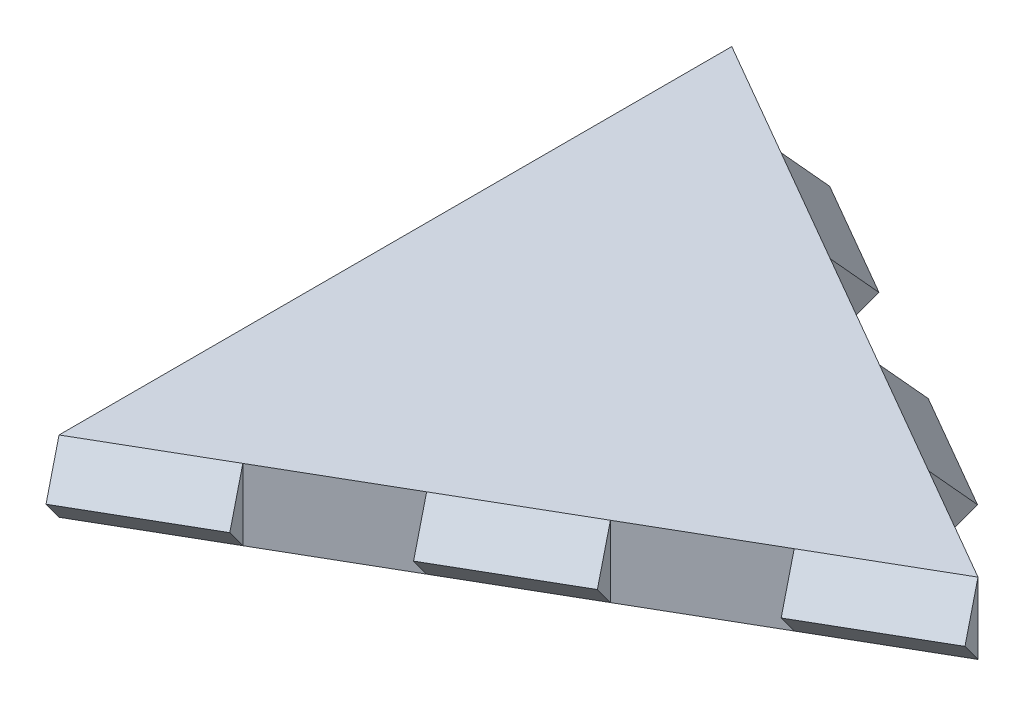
from build123d import *

# Parameters (mm, degrees)
SALIENTE_EXTRUIR1_DEPTH = 4.24
CROQUIS4_W              = 40
CROQUIS4_H              = 4.24
SALIENTE_EXTRUIR2_DEPTH = 4.24
CORTAR_EXTRUIR1_DEPTH   = 4.24
CORTAR_EXTRUIR2_DEPTH   = 54.24
CROQUIS7_W              = 40
CROQUIS7_H              = 4.24
SALIENTE_EXTRUIR3_DEPTH = 4.24
CROQUIS8_W              = 4.24
CROQUIS8_H              = 8
CORTAR_EXTRUIR3_DEPTH   = 4.24
CORTAR_EXTRUIR4_DEPTH   = 34.24
CROQUIS10_W             = 40
CROQUIS10_H             = 4.24
SALIENTE_EXTRUIR4_DEPTH = 4.24
CORTAR_EXTRUIR5_DEPTH   = 4.24
CORTAR_EXTRUIR6_DEPTH   = 44.24


with BuildPart() as part:
    # Croquis1 → Saliente-Extruir1 (new body)
    with BuildSketch(Plane(origin=(0, 0, 0), x_dir=(1, 0, 0), z_dir=(0, 1, 0))):
        Polygon((23.094010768, 0), (-11.547005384, 20), (-11.547005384, -20), align=None)
    extrude(amount=SALIENTE_EXTRUIR1_DEPTH)

    # Croquis4 → Saliente-Extruir2 (add)
    with BuildSketch(Plane(origin=(5.773502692, 0, 10), x_dir=(0.8660254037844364, 0, -0.500000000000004), z_dir=(0.500000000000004, 0, 0.8660254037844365))):
        with Locations((0, 2.12)):
            Rectangle(CROQUIS4_W, CROQUIS4_H)
    extrude(amount=SALIENTE_EXTRUIR2_DEPTH)

    # Croquis5 → Cortar-Extruir1 (cut)
    with BuildSketch(Plane(origin=(0, 4.24, 0), x_dir=(1, 0, 0), z_dir=(0, 1, 0))):
        Polygon((11.357604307, -11.671947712), (9.237604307, -8), (16.165807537, -4), (18.285807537, -7.671947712), align=None)
        Polygon((4.429401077, -15.671947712), (2.309401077, -12), (-4.618802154, -16), (-2.498802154, -19.671947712), align=None)
    extrude(amount=-CORTAR_EXTRUIR1_DEPTH, mode=Mode.SUBTRACT)

    # Croquis6 → Cortar-Extruir2 (cut)
    with BuildSketch(Plane(origin=(-17.320508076, 0, 10), x_dir=(0.5000000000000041, 0, 0.8660254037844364), z_dir=(-0.8660254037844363, 0, 0.500000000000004))):
        Polygon((11.547005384, 4.24), (13.667005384, 2.12), (11.547005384, 0), (15.787005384, 0), (15.787005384, 4.24), align=None)
    extrude(amount=-CORTAR_EXTRUIR2_DEPTH, mode=Mode.SUBTRACT)

    # Croquis7 → Saliente-Extruir3 (add)
    with BuildSketch(Plane.ZY.offset(11.547005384)):
        with Locations((0, 2.12)):
            Rectangle(CROQUIS7_W, CROQUIS7_H)
    extrude(amount=SALIENTE_EXTRUIR3_DEPTH)

    # Croquis8 → Cortar-Extruir3 (cut)
    with BuildSketch(Plane(origin=(0, 4.24, 0), x_dir=(1, 0, 0), z_dir=(0, 1, 0))):
        with Locations((-13.667005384, 0)):
            Rectangle(CROQUIS8_W, CROQUIS8_H)
        with Locations((-13.667005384, 16)):
            Rectangle(CROQUIS8_W, CROQUIS8_H)
        with Locations((-13.667005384, -16)):
            Rectangle(CROQUIS8_W, CROQUIS8_H)
    extrude(amount=-CORTAR_EXTRUIR3_DEPTH, mode=Mode.SUBTRACT)

    # Croquis9 → Cortar-Extruir4 (cut)
    with BuildSketch(Plane.XY.offset(12)):
        Polygon((-11.547005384, 4.24), (-13.667005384, 2.12), (-11.547005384, 0), (-15.787005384, 0), (-15.787005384, 4.24), align=None)
    extrude(amount=-CORTAR_EXTRUIR4_DEPTH, mode=Mode.SUBTRACT)

    # Croquis10 → Saliente-Extruir4 (add)
    with BuildSketch(Plane(origin=(5.773502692, 0, -10), x_dir=(-0.8660254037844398, 0, -0.499999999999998), z_dir=(0.49999999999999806, 0, -0.8660254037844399))):
        with Locations((0, 2.12)):
            Rectangle(CROQUIS10_W, CROQUIS10_H)
    extrude(amount=SALIENTE_EXTRUIR4_DEPTH)

    # Croquis11 → Cortar-Extruir5 (cut)
    with BuildSketch(Plane(origin=(0, 4.24, 0), x_dir=(1, 0, 0), z_dir=(0, 1, 0))):
        Polygon((7.893502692, 13.671947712), (11.357604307, 11.671947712), (9.237604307, 8), (2.309401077, 12), (4.429401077, 15.671947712), align=None)
        Polygon((16.165807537, 4), (18.285807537, 7.671947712), (25.214010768, 3.671947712), (23.094010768, 0), align=None)
        Polygon((-4.618802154, 16), (-2.498802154, 19.671947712), (-9.427005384, 23.671947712), (-11.547005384, 20), align=None)
    extrude(amount=-CORTAR_EXTRUIR5_DEPTH, mode=Mode.SUBTRACT)

    # Croquis12 → Cortar-Extruir6 (cut)
    with BuildSketch(Plane(origin=(10.392304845, 0, 6), x_dir=(0.4999999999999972, 0, -0.8660254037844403), z_dir=(0.8660254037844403, 0, 0.4999999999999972))):
        Polygon((11.547005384, 4.24), (13.667005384, 2.12), (11.547005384, 0), (15.787005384, 0), (15.787005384, 4.24), align=None)
    extrude(amount=-CORTAR_EXTRUIR6_DEPTH, mode=Mode.SUBTRACT)


solid = part.part
